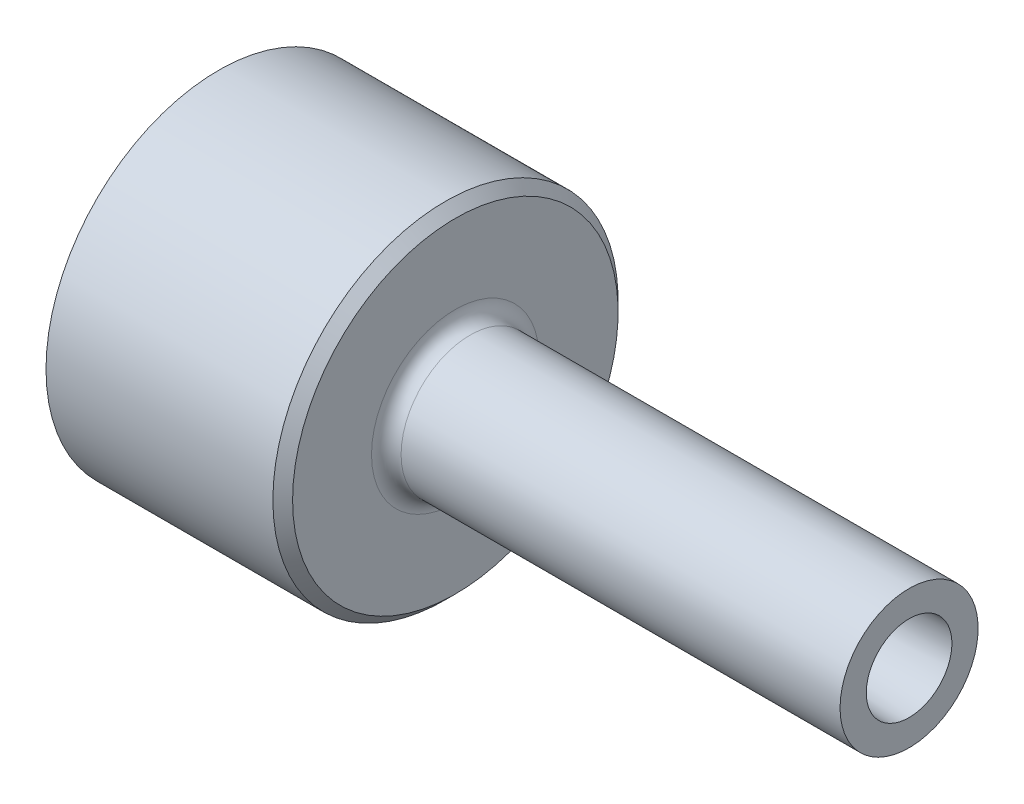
ISO-10303-21;
HEADER;
FILE_DESCRIPTION(('STEP AP214'),'2;1');
FILE_NAME('part.step','',(''),(''),'','','');
FILE_SCHEMA(('AUTOMOTIVE_DESIGN { 1 0 10303 214 1 1 1 1 }'));
ENDSEC;
DATA;
#1=APPLICATION_CONTEXT('core data for automotive mechanical design processes');
#2=APPLICATION_PROTOCOL_DEFINITION('international standard','automotive_design',2000,#1);
#3=PRODUCT_CONTEXT('',#1,'mechanical');
#4=PRODUCT('Part','Part','',(#3));
#5=PRODUCT_RELATED_PRODUCT_CATEGORY('part','',(#4));
#6=PRODUCT_DEFINITION_FORMATION('','',#4);
#7=PRODUCT_DEFINITION_CONTEXT('part definition',#1,'design');
#8=PRODUCT_DEFINITION('design','',#6,#7);
#9=PRODUCT_DEFINITION_SHAPE('','',#8);
#10=(LENGTH_UNIT() NAMED_UNIT(*) SI_UNIT(.MILLI.,.METRE.));
#11=(NAMED_UNIT(*) PLANE_ANGLE_UNIT() SI_UNIT($,.RADIAN.));
#12=(NAMED_UNIT(*) SI_UNIT($,.STERADIAN.) SOLID_ANGLE_UNIT());
#13=UNCERTAINTY_MEASURE_WITH_UNIT(LENGTH_MEASURE(1.E-05),#10,'distance_accuracy_value','');
#14=(GEOMETRIC_REPRESENTATION_CONTEXT(3) GLOBAL_UNCERTAINTY_ASSIGNED_CONTEXT((#13)) GLOBAL_UNIT_ASSIGNED_CONTEXT((#10,
#11,#12)) REPRESENTATION_CONTEXT('',''));
#15=CARTESIAN_POINT('',(0.,0.,0.));
#16=DIRECTION('',(0.,0.,1.));
#17=DIRECTION('',(1.,0.,0.));
#18=AXIS2_PLACEMENT_3D('',#15,#16,#17);
#19=CARTESIAN_POINT('',(0.,0.,0.));
#20=DIRECTION('',(-1.,0.,0.));
#21=DIRECTION('',(0.,0.,1.));
#22=AXIS2_PLACEMENT_3D('',#19,#20,#21);
#23=CYLINDRICAL_SURFACE('',#22,17.5);
#24=CARTESIAN_POINT('',(23.,0.,0.));
#25=DIRECTION('',(-1.,0.,0.));
#26=DIRECTION('',(0.,0.,1.));
#27=AXIS2_PLACEMENT_3D('',#24,#25,#26);
#28=CIRCLE('',#27,17.5);
#29=CARTESIAN_POINT('',(23.,0.,17.5));
#30=VERTEX_POINT('',#29);
#31=EDGE_CURVE('E21',#30,#30,#28,.T.);
#32=ORIENTED_EDGE('',*,*,#31,.T.);
#33=EDGE_LOOP('',(#32));
#34=FACE_BOUND('',#33,.T.);
#35=CARTESIAN_POINT('',(0.,0.,0.));
#36=DIRECTION('',(-1.,0.,0.));
#37=DIRECTION('',(0.,0.,1.));
#38=AXIS2_PLACEMENT_3D('',#35,#36,#37);
#39=CIRCLE('',#38,17.5);
#40=CARTESIAN_POINT('',(0.,0.,17.5));
#41=VERTEX_POINT('',#40);
#42=EDGE_CURVE('E55',#41,#41,#39,.T.);
#43=ORIENTED_EDGE('',*,*,#42,.F.);
#44=EDGE_LOOP('',(#43));
#45=FACE_BOUND('',#44,.T.);
#46=ADVANCED_FACE('F13',(#34,#45),#23,.T.);
#47=CARTESIAN_POINT('',(24.,17.5,0.));
#48=DIRECTION('',(-1.,0.,0.));
#49=DIRECTION('',(0.,0.,1.));
#50=AXIS2_PLACEMENT_3D('',#47,#48,#49);
#51=PLANE('',#50);
#52=CARTESIAN_POINT('',(24.,0.,0.));
#53=DIRECTION('',(-1.,0.,0.));
#54=DIRECTION('',(0.,0.,1.));
#55=AXIS2_PLACEMENT_3D('',#52,#53,#54);
#56=CIRCLE('',#55,16.5);
#57=CARTESIAN_POINT('',(24.,0.,16.5));
#58=VERTEX_POINT('',#57);
#59=EDGE_CURVE('E8',#58,#58,#56,.F.);
#60=ORIENTED_EDGE('',*,*,#59,.T.);
#61=EDGE_LOOP('',(#60));
#62=FACE_BOUND('',#61,.T.);
#63=CARTESIAN_POINT('',(24.,0.,0.));
#64=DIRECTION('',(-1.,0.,0.));
#65=DIRECTION('',(0.,0.,1.));
#66=AXIS2_PLACEMENT_3D('',#63,#64,#65);
#67=CIRCLE('',#66,8.5);
#68=CARTESIAN_POINT('',(24.,0.,8.5));
#69=VERTEX_POINT('',#68);
#70=EDGE_CURVE('E29',#69,#69,#67,.T.);
#71=ORIENTED_EDGE('',*,*,#70,.T.);
#72=EDGE_LOOP('',(#71));
#73=FACE_BOUND('',#72,.T.);
#74=ADVANCED_FACE('F62',(#62,#73),#51,.F.);
#75=CARTESIAN_POINT('',(25.5,0.,0.));
#76=DIRECTION('',(-1.,0.,0.));
#77=DIRECTION('',(0.,0.,1.));
#78=AXIS2_PLACEMENT_3D('',#75,#76,#77);
#79=TOROIDAL_SURFACE('',#78,8.5,1.5);
#80=ORIENTED_EDGE('',*,*,#70,.F.);
#81=EDGE_LOOP('',(#80));
#82=FACE_BOUND('',#81,.T.);
#83=CARTESIAN_POINT('',(25.5,0.,0.));
#84=DIRECTION('',(-1.,0.,0.));
#85=DIRECTION('',(0.,0.,1.));
#86=AXIS2_PLACEMENT_3D('',#83,#84,#85);
#87=CIRCLE('',#86,7.);
#88=CARTESIAN_POINT('',(25.5,0.,7.));
#89=VERTEX_POINT('',#88);
#90=EDGE_CURVE('E36',#89,#89,#87,.T.);
#91=ORIENTED_EDGE('',*,*,#90,.T.);
#92=EDGE_LOOP('',(#91));
#93=FACE_BOUND('',#92,.T.);
#94=ADVANCED_FACE('F66',(#82,#93),#79,.F.);
#95=CARTESIAN_POINT('',(0.,0.,0.));
#96=DIRECTION('',(-1.,0.,0.));
#97=DIRECTION('',(0.,0.,1.));
#98=AXIS2_PLACEMENT_3D('',#95,#96,#97);
#99=CYLINDRICAL_SURFACE('',#98,7.);
#100=ORIENTED_EDGE('',*,*,#90,.F.);
#101=EDGE_LOOP('',(#100));
#102=FACE_BOUND('',#101,.T.);
#103=CARTESIAN_POINT('',(70.,0.,0.));
#104=DIRECTION('',(-1.,0.,0.));
#105=DIRECTION('',(0.,0.,1.));
#106=AXIS2_PLACEMENT_3D('',#103,#104,#105);
#107=CIRCLE('',#106,7.);
#108=CARTESIAN_POINT('',(70.,0.,7.));
#109=VERTEX_POINT('',#108);
#110=EDGE_CURVE('E42',#109,#109,#107,.T.);
#111=ORIENTED_EDGE('',*,*,#110,.T.);
#112=EDGE_LOOP('',(#111));
#113=FACE_BOUND('',#112,.T.);
#114=ADVANCED_FACE('F71',(#102,#113),#99,.T.);
#115=CARTESIAN_POINT('',(70.,4.33969155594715,0.));
#116=DIRECTION('',(-1.,0.,0.));
#117=DIRECTION('',(0.,0.,1.));
#118=AXIS2_PLACEMENT_3D('',#115,#116,#117);
#119=PLANE('',#118);
#120=ORIENTED_EDGE('',*,*,#110,.F.);
#121=EDGE_LOOP('',(#120));
#122=FACE_BOUND('',#121,.T.);
#123=CARTESIAN_POINT('',(70.,0.,0.));
#124=DIRECTION('',(-1.,0.,0.));
#125=DIRECTION('',(0.,0.,1.));
#126=AXIS2_PLACEMENT_3D('',#123,#124,#125);
#127=CIRCLE('',#126,4.33969155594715);
#128=CARTESIAN_POINT('',(70.,0.,4.33969155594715));
#129=VERTEX_POINT('',#128);
#130=EDGE_CURVE('E46',#129,#129,#127,.T.);
#131=ORIENTED_EDGE('',*,*,#130,.T.);
#132=EDGE_LOOP('',(#131));
#133=FACE_BOUND('',#132,.T.);
#134=ADVANCED_FACE('F75',(#122,#133),#119,.F.);
#135=CARTESIAN_POINT('',(3.,0.,0.));
#136=DIRECTION('',(1.,0.,0.));
#137=DIRECTION('',(0.,0.,-1.));
#138=AXIS2_PLACEMENT_3D('',#135,#136,#137);
#139=CONICAL_SURFACE('',#138,2.,0.0349065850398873);
#140=ORIENTED_EDGE('',*,*,#130,.F.);
#141=EDGE_LOOP('',(#140));
#142=FACE_BOUND('',#141,.T.);
#143=CARTESIAN_POINT('',(3.,0.,0.));
#144=DIRECTION('',(-1.,0.,0.));
#145=DIRECTION('',(0.,0.,1.));
#146=AXIS2_PLACEMENT_3D('',#143,#144,#145);
#147=CIRCLE('',#146,2.);
#148=CARTESIAN_POINT('',(3.,0.,2.));
#149=VERTEX_POINT('',#148);
#150=EDGE_CURVE('E49',#149,#149,#147,.T.);
#151=ORIENTED_EDGE('',*,*,#150,.T.);
#152=EDGE_LOOP('',(#151));
#153=FACE_BOUND('',#152,.T.);
#154=ADVANCED_FACE('F79',(#142,#153),#139,.F.);
#155=CARTESIAN_POINT('',(-11.7373835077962,0.,0.));
#156=DIRECTION('',(-1.,0.,0.));
#157=DIRECTION('',(0.,0.,1.));
#158=AXIS2_PLACEMENT_3D('',#155,#156,#157);
#159=DEGENERATE_TOROIDAL_SURFACE('',#158,0.794553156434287,15.,.F.);
#160=ORIENTED_EDGE('',*,*,#150,.F.);
#161=EDGE_LOOP('',(#160));
#162=FACE_BOUND('',#161,.T.);
#163=CARTESIAN_POINT('',(0.,0.,0.));
#164=DIRECTION('',(-1.,0.,0.));
#165=DIRECTION('',(0.,0.,1.));
#166=AXIS2_PLACEMENT_3D('',#163,#164,#165);
#167=CIRCLE('',#166,8.54535200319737);
#168=CARTESIAN_POINT('',(0.,0.,8.54535200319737));
#169=VERTEX_POINT('',#168);
#170=EDGE_CURVE('E52',#169,#169,#167,.T.);
#171=ORIENTED_EDGE('',*,*,#170,.T.);
#172=EDGE_LOOP('',(#171));
#173=FACE_BOUND('',#172,.T.);
#174=ADVANCED_FACE('F83',(#162,#173),#159,.T.);
#175=CARTESIAN_POINT('',(0.,8.54535200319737,0.));
#176=DIRECTION('',(1.,0.,0.));
#177=DIRECTION('',(0.,0.,-1.));
#178=AXIS2_PLACEMENT_3D('',#175,#176,#177);
#179=PLANE('',#178);
#180=ORIENTED_EDGE('',*,*,#170,.F.);
#181=EDGE_LOOP('',(#180));
#182=FACE_BOUND('',#181,.T.);
#183=ORIENTED_EDGE('',*,*,#42,.T.);
#184=EDGE_LOOP('',(#183));
#185=FACE_BOUND('',#184,.T.);
#186=ADVANCED_FACE('F59',(#182,#185),#179,.F.);
#187=CARTESIAN_POINT('',(23.,0.,0.));
#188=DIRECTION('',(-1.,0.,0.));
#189=DIRECTION('',(0.,0.,1.));
#190=AXIS2_PLACEMENT_3D('',#187,#188,#189);
#191=CONICAL_SURFACE('',#190,17.5,0.785398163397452);
#192=ORIENTED_EDGE('',*,*,#59,.F.);
#193=EDGE_LOOP('',(#192));
#194=FACE_BOUND('',#193,.T.);
#195=ORIENTED_EDGE('',*,*,#31,.F.);
#196=EDGE_LOOP('',(#195));
#197=FACE_BOUND('',#196,.T.);
#198=ADVANCED_FACE('F15',(#194,#197),#191,.T.);
#199=CLOSED_SHELL('',(#46,#74,#94,#114,#134,#154,#174,#186,#198));
#200=MANIFOLD_SOLID_BREP('B1',#199);
#201=ADVANCED_BREP_SHAPE_REPRESENTATION('',(#18,#200),#14);
#202=SHAPE_DEFINITION_REPRESENTATION(#9,#201);
ENDSEC;
END-ISO-10303-21;
